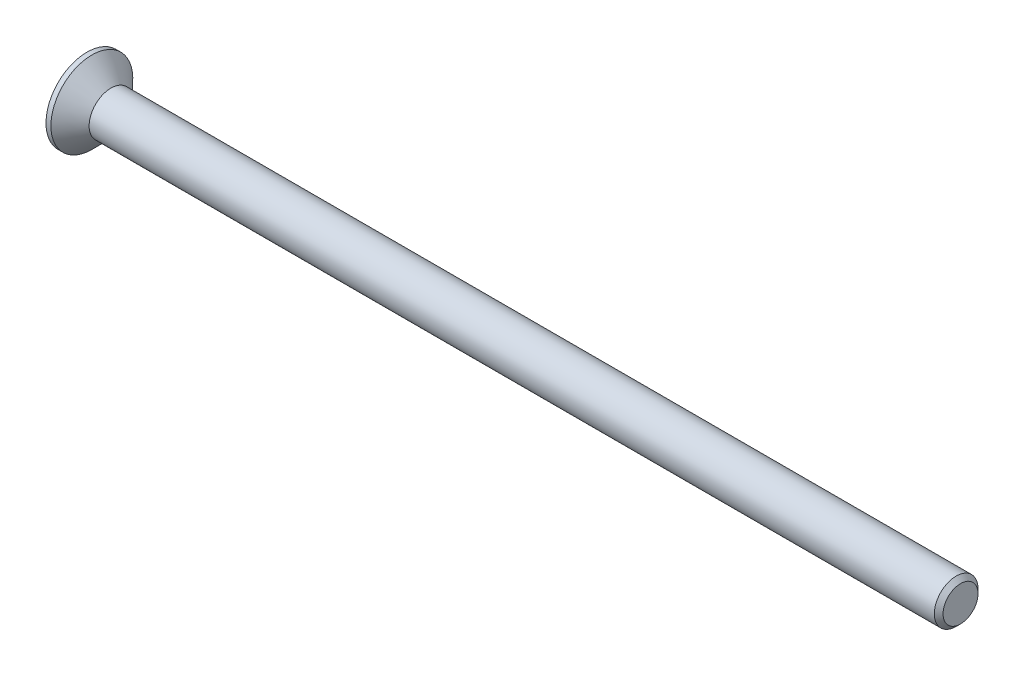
from build123d import *

# Parameters (mm, degrees)
CHAMFER1_SIZE      = 0.4
CUT_EXTRUDE1_DEPTH = 1.9


with BuildPart() as part:
    # Sketch1 → Revolve1 (revolve)
    with BuildSketch(Plane.XY, mode=Mode.PRIVATE) as revolve1_sk:
        Polygon((-2.2, 3.75), (-2.2, 0), (77.8, 0), (77.8, 2), (0, 2), (-1.75, 3.75), align=None)
    revolve(revolve1_sk.sketch.rotate(Axis((-2.2, 0, 0), (1, 0, 0)), 180), axis=Axis((-2.2, 0, 0), (1, 0, 0)))

    # Chamfer1
    chamfer1_edges = [part.edges().sort_by_distance(p)[0] for p in [
        (77.8, 2, 0),
    ]]
    chamfer(chamfer1_edges, length=CHAMFER1_SIZE)

    # Sketch2 → Cut-Extrude1 (cut)
    with BuildSketch(Plane.ZY.offset(2.2)):
        Polygon((-0.55, 2.2), (0.55, 2.2), (0.55, 0.55), (2.2, 0.55), (2.2, -0.55), (0.55, -0.55), (0.55, -2.2), (-0.55, -2.2), (-0.55, -0.55), (-2.2, -0.55), (-2.2, 0.55), (-0.55, 0.55), align=None)
    extrude(amount=-CUT_EXTRUDE1_DEPTH, mode=Mode.SUBTRACT)


solid = part.part
